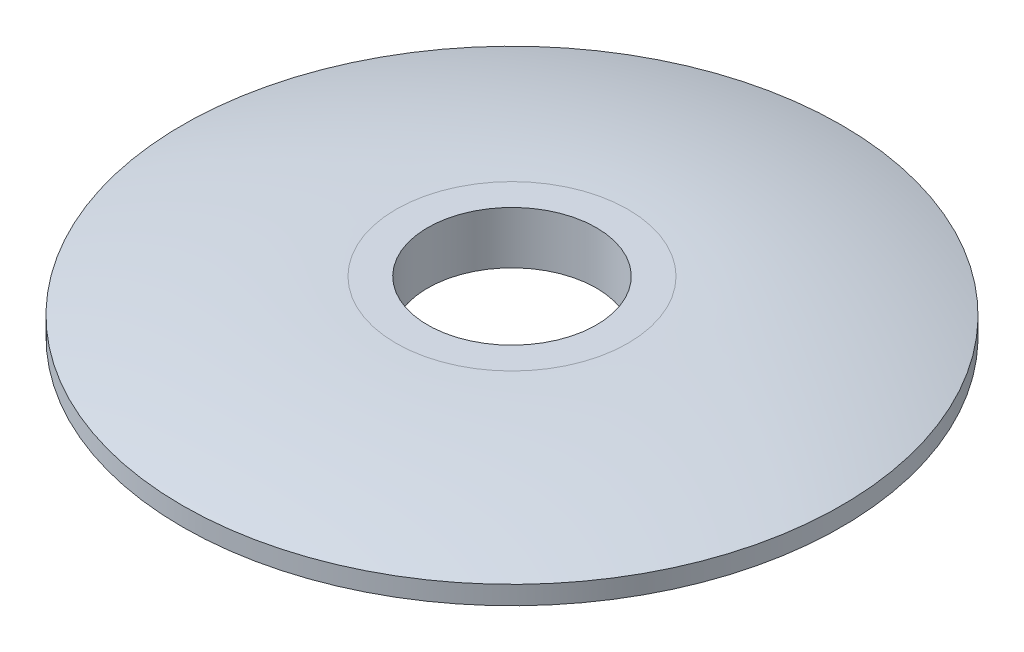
ISO-10303-21;
HEADER;
FILE_DESCRIPTION(('STEP AP214'),'2;1');
FILE_NAME('part.step','',(''),(''),'','','');
FILE_SCHEMA(('AUTOMOTIVE_DESIGN { 1 0 10303 214 1 1 1 1 }'));
ENDSEC;
DATA;
#1=APPLICATION_CONTEXT('core data for automotive mechanical design processes');
#2=APPLICATION_PROTOCOL_DEFINITION('international standard','automotive_design',2000,#1);
#3=PRODUCT_CONTEXT('',#1,'mechanical');
#4=PRODUCT('Part','Part','',(#3));
#5=PRODUCT_RELATED_PRODUCT_CATEGORY('part','',(#4));
#6=PRODUCT_DEFINITION_FORMATION('','',#4);
#7=PRODUCT_DEFINITION_CONTEXT('part definition',#1,'design');
#8=PRODUCT_DEFINITION('design','',#6,#7);
#9=PRODUCT_DEFINITION_SHAPE('','',#8);
#10=(LENGTH_UNIT() NAMED_UNIT(*) SI_UNIT(.MILLI.,.METRE.));
#11=(NAMED_UNIT(*) PLANE_ANGLE_UNIT() SI_UNIT($,.RADIAN.));
#12=(NAMED_UNIT(*) SI_UNIT($,.STERADIAN.) SOLID_ANGLE_UNIT());
#13=UNCERTAINTY_MEASURE_WITH_UNIT(LENGTH_MEASURE(1.E-05),#10,'distance_accuracy_value','');
#14=(GEOMETRIC_REPRESENTATION_CONTEXT(3) GLOBAL_UNCERTAINTY_ASSIGNED_CONTEXT((#13)) GLOBAL_UNIT_ASSIGNED_CONTEXT((#10,
#11,#12)) REPRESENTATION_CONTEXT('',''));
#15=CARTESIAN_POINT('',(0.,0.,0.));
#16=DIRECTION('',(0.,0.,1.));
#17=DIRECTION('',(1.,0.,0.));
#18=AXIS2_PLACEMENT_3D('',#15,#16,#17);
#19=CARTESIAN_POINT('',(8.,0.,0.));
#20=DIRECTION('',(0.,-1.,0.));
#21=DIRECTION('',(0.,0.,-1.));
#22=AXIS2_PLACEMENT_3D('',#19,#20,#21);
#23=PLANE('',#22);
#24=CARTESIAN_POINT('',(0.,0.,0.));
#25=DIRECTION('',(0.,-1.,0.));
#26=DIRECTION('',(0.,0.,-1.));
#27=AXIS2_PLACEMENT_3D('',#24,#25,#26);
#28=CIRCLE('',#27,31.25);
#29=CARTESIAN_POINT('',(0.,0.,-31.25));
#30=VERTEX_POINT('',#29);
#31=EDGE_CURVE('E50',#30,#30,#28,.T.);
#32=ORIENTED_EDGE('',*,*,#31,.T.);
#33=EDGE_LOOP('',(#32));
#34=FACE_BOUND('',#33,.T.);
#35=CARTESIAN_POINT('',(0.,0.,0.));
#36=DIRECTION('',(0.,-1.,0.));
#37=DIRECTION('',(0.,0.,-1.));
#38=AXIS2_PLACEMENT_3D('',#35,#36,#37);
#39=CIRCLE('',#38,8.);
#40=CARTESIAN_POINT('',(0.,0.,-8.));
#41=VERTEX_POINT('',#40);
#42=EDGE_CURVE('E10',#41,#41,#39,.T.);
#43=ORIENTED_EDGE('',*,*,#42,.F.);
#44=EDGE_LOOP('',(#43));
#45=FACE_BOUND('',#44,.T.);
#46=ADVANCED_FACE('F31',(#34,#45),#23,.T.);
#47=CARTESIAN_POINT('',(0.,0.,0.));
#48=DIRECTION('',(0.,-1.,0.));
#49=DIRECTION('',(0.,0.,-1.));
#50=AXIS2_PLACEMENT_3D('',#47,#48,#49);
#51=CYLINDRICAL_SURFACE('',#50,8.);
#52=ORIENTED_EDGE('',*,*,#42,.T.);
#53=EDGE_LOOP('',(#52));
#54=FACE_BOUND('',#53,.T.);
#55=CARTESIAN_POINT('',(0.,4.96031746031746,0.));
#56=DIRECTION('',(0.,-1.,0.));
#57=DIRECTION('',(0.,0.,-1.));
#58=AXIS2_PLACEMENT_3D('',#55,#56,#57);
#59=CIRCLE('',#58,8.);
#60=CARTESIAN_POINT('',(0.,4.96031746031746,-8.));
#61=VERTEX_POINT('',#60);
#62=EDGE_CURVE('E37',#61,#61,#59,.T.);
#63=ORIENTED_EDGE('',*,*,#62,.F.);
#64=EDGE_LOOP('',(#63));
#65=FACE_BOUND('',#64,.T.);
#66=ADVANCED_FACE('F68',(#54,#65),#51,.F.);
#67=CARTESIAN_POINT('',(8.,4.96031746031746,0.));
#68=DIRECTION('',(0.,1.,0.));
#69=DIRECTION('',(0.,0.,1.));
#70=AXIS2_PLACEMENT_3D('',#67,#68,#69);
#71=PLANE('',#70);
#72=ORIENTED_EDGE('',*,*,#62,.T.);
#73=EDGE_LOOP('',(#72));
#74=FACE_BOUND('',#73,.T.);
#75=CARTESIAN_POINT('',(0.,4.96031746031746,0.));
#76=DIRECTION('',(0.,-1.,0.));
#77=DIRECTION('',(0.,0.,-1.));
#78=AXIS2_PLACEMENT_3D('',#75,#76,#77);
#79=CIRCLE('',#78,11.);
#80=CARTESIAN_POINT('',(0.,4.96031746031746,-11.));
#81=VERTEX_POINT('',#80);
#82=EDGE_CURVE('E41',#81,#81,#79,.T.);
#83=ORIENTED_EDGE('',*,*,#82,.F.);
#84=EDGE_LOOP('',(#83));
#85=FACE_BOUND('',#84,.T.);
#86=ADVANCED_FACE('F64',(#74,#85),#71,.T.);
#87=CARTESIAN_POINT('',(0.,-60.6938830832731,0.));
#88=DIRECTION('',(0.,-1.,0.));
#89=DIRECTION('',(0.,0.,-1.));
#90=AXIS2_PLACEMENT_3D('',#87,#88,#89);
#91=DEGENERATE_TOROIDAL_SURFACE('',#90,11.,65.6542005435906,.T.);
#92=ORIENTED_EDGE('',*,*,#82,.T.);
#93=EDGE_LOOP('',(#92));
#94=FACE_BOUND('',#93,.T.);
#95=CARTESIAN_POINT('',(0.,1.75939184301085,0.));
#96=DIRECTION('',(0.,-1.,0.));
#97=DIRECTION('',(0.,0.,-1.));
#98=AXIS2_PLACEMENT_3D('',#95,#96,#97);
#99=CIRCLE('',#98,31.25);
#100=CARTESIAN_POINT('',(0.,1.75939184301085,-31.25));
#101=VERTEX_POINT('',#100);
#102=EDGE_CURVE('E45',#101,#101,#99,.T.);
#103=ORIENTED_EDGE('',*,*,#102,.F.);
#104=EDGE_LOOP('',(#103));
#105=FACE_BOUND('',#104,.T.);
#106=ADVANCED_FACE('F58',(#94,#105),#91,.T.);
#107=CARTESIAN_POINT('',(0.,0.,0.));
#108=DIRECTION('',(0.,-1.,0.));
#109=DIRECTION('',(0.,0.,-1.));
#110=AXIS2_PLACEMENT_3D('',#107,#108,#109);
#111=CYLINDRICAL_SURFACE('',#110,31.25);
#112=ORIENTED_EDGE('',*,*,#102,.T.);
#113=EDGE_LOOP('',(#112));
#114=FACE_BOUND('',#113,.T.);
#115=ORIENTED_EDGE('',*,*,#31,.F.);
#116=EDGE_LOOP('',(#115));
#117=FACE_BOUND('',#116,.T.);
#118=ADVANCED_FACE('F56',(#114,#117),#111,.T.);
#119=CLOSED_SHELL('',(#46,#66,#86,#106,#118));
#120=MANIFOLD_SOLID_BREP('B2',#119);
#121=ADVANCED_BREP_SHAPE_REPRESENTATION('',(#18,#120),#14);
#122=SHAPE_DEFINITION_REPRESENTATION(#9,#121);
ENDSEC;
END-ISO-10303-21;
